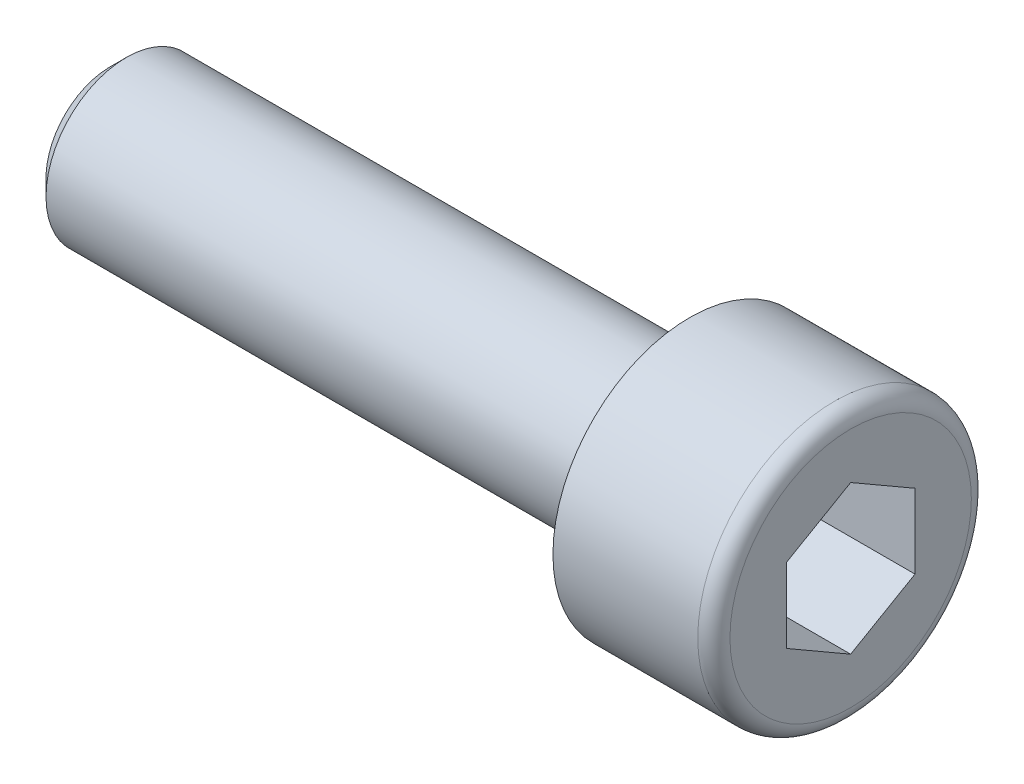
ISO-10303-21;
HEADER;
FILE_DESCRIPTION(('STEP AP214'),'2;1');
FILE_NAME('part.step','',(''),(''),'','','');
FILE_SCHEMA(('AUTOMOTIVE_DESIGN { 1 0 10303 214 1 1 1 1 }'));
ENDSEC;
DATA;
#1=APPLICATION_CONTEXT('core data for automotive mechanical design processes');
#2=APPLICATION_PROTOCOL_DEFINITION('international standard','automotive_design',2000,#1);
#3=PRODUCT_CONTEXT('',#1,'mechanical');
#4=PRODUCT('Part','Part','',(#3));
#5=PRODUCT_RELATED_PRODUCT_CATEGORY('part','',(#4));
#6=PRODUCT_DEFINITION_FORMATION('','',#4);
#7=PRODUCT_DEFINITION_CONTEXT('part definition',#1,'design');
#8=PRODUCT_DEFINITION('design','',#6,#7);
#9=PRODUCT_DEFINITION_SHAPE('','',#8);
#10=(LENGTH_UNIT() NAMED_UNIT(*) SI_UNIT(.MILLI.,.METRE.));
#11=(NAMED_UNIT(*) PLANE_ANGLE_UNIT() SI_UNIT($,.RADIAN.));
#12=(NAMED_UNIT(*) SI_UNIT($,.STERADIAN.) SOLID_ANGLE_UNIT());
#13=UNCERTAINTY_MEASURE_WITH_UNIT(LENGTH_MEASURE(1.E-05),#10,'distance_accuracy_value','');
#14=(GEOMETRIC_REPRESENTATION_CONTEXT(3) GLOBAL_UNCERTAINTY_ASSIGNED_CONTEXT((#13)) GLOBAL_UNIT_ASSIGNED_CONTEXT((#10,
#11,#12)) REPRESENTATION_CONTEXT('',''));
#15=CARTESIAN_POINT('',(0.,0.,0.));
#16=DIRECTION('',(0.,0.,1.));
#17=DIRECTION('',(1.,0.,0.));
#18=AXIS2_PLACEMENT_3D('',#15,#16,#17);
#19=CARTESIAN_POINT('',(5.,4.25,0.));
#20=DIRECTION('',(-1.,0.,0.));
#21=DIRECTION('',(0.,0.,1.));
#22=AXIS2_PLACEMENT_3D('',#19,#20,#21);
#23=PLANE('',#22);
#24=CARTESIAN_POINT('',(5.,0.,0.));
#25=DIRECTION('',(-1.,0.,0.));
#26=DIRECTION('',(0.,0.,1.));
#27=AXIS2_PLACEMENT_3D('',#24,#25,#26);
#28=CIRCLE('',#27,3.75);
#29=CARTESIAN_POINT('',(5.,0.,3.75));
#30=VERTEX_POINT('',#29);
#31=EDGE_CURVE('E465',#30,#30,#28,.F.);
#32=ORIENTED_EDGE('',*,*,#31,.T.);
#33=EDGE_LOOP('',(#32));
#34=FACE_BOUND('',#33,.T.);
#35=DIRECTION('',(0.,0.500000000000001,-0.866025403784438));
#36=VECTOR('',#35,1.);
#37=CARTESIAN_POINT('',(5.,-1.15470053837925,-2.));
#38=LINE('',#37,#36);
#39=CARTESIAN_POINT('',(5.,-2.3094010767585,0.));
#40=VERTEX_POINT('',#39);
#41=CARTESIAN_POINT('',(5.,-1.15470053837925,-2.));
#42=VERTEX_POINT('',#41);
#43=EDGE_CURVE('E418',#40,#42,#38,.T.);
#44=ORIENTED_EDGE('',*,*,#43,.F.);
#45=DIRECTION('',(0.,-0.5,-0.866025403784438));
#46=VECTOR('',#45,1.);
#47=CARTESIAN_POINT('',(5.,-1.15470053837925,2.));
#48=LINE('',#47,#46);
#49=CARTESIAN_POINT('',(5.,-1.15470053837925,2.));
#50=VERTEX_POINT('',#49);
#51=EDGE_CURVE('E364',#50,#40,#48,.T.);
#52=ORIENTED_EDGE('',*,*,#51,.F.);
#53=DIRECTION('',(0.,-1.,0.));
#54=VECTOR('',#53,1.);
#55=CARTESIAN_POINT('',(5.,1.15470053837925,2.));
#56=LINE('',#55,#54);
#57=CARTESIAN_POINT('',(5.,1.15470053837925,2.));
#58=VERTEX_POINT('',#57);
#59=EDGE_CURVE('E432',#58,#50,#56,.T.);
#60=ORIENTED_EDGE('',*,*,#59,.F.);
#61=DIRECTION('',(0.,-0.500000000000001,0.866025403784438));
#62=VECTOR('',#61,1.);
#63=CARTESIAN_POINT('',(5.,1.15470053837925,2.));
#64=LINE('',#63,#62);
#65=CARTESIAN_POINT('',(5.,2.3094010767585,0.));
#66=VERTEX_POINT('',#65);
#67=EDGE_CURVE('E426',#66,#58,#64,.T.);
#68=ORIENTED_EDGE('',*,*,#67,.F.);
#69=DIRECTION('',(0.,0.500000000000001,0.866025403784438));
#70=VECTOR('',#69,1.);
#71=CARTESIAN_POINT('',(5.,1.15470053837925,-2.));
#72=LINE('',#71,#70);
#73=CARTESIAN_POINT('',(5.,1.15470053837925,-2.));
#74=VERTEX_POINT('',#73);
#75=EDGE_CURVE('E424',#74,#66,#72,.T.);
#76=ORIENTED_EDGE('',*,*,#75,.F.);
#77=DIRECTION('',(0.,1.,0.));
#78=VECTOR('',#77,1.);
#79=CARTESIAN_POINT('',(5.,1.15470053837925,-2.));
#80=LINE('',#79,#78);
#81=EDGE_CURVE('E407',#42,#74,#80,.T.);
#82=ORIENTED_EDGE('',*,*,#81,.F.);
#83=EDGE_LOOP('',(#44,#52,#60,#68,#76,#82));
#84=FACE_BOUND('',#83,.T.);
#85=ADVANCED_FACE('F350',(#34,#84),#23,.F.);
#86=CARTESIAN_POINT('',(-120.,0.,0.));
#87=DIRECTION('',(-1.,0.,0.));
#88=DIRECTION('',(0.,0.,1.));
#89=AXIS2_PLACEMENT_3D('',#86,#87,#88);
#90=CYLINDRICAL_SURFACE('',#89,4.25);
#91=CARTESIAN_POINT('',(4.5,0.,0.));
#92=DIRECTION('',(-1.,0.,0.));
#93=DIRECTION('',(0.,0.,1.));
#94=AXIS2_PLACEMENT_3D('',#91,#92,#93);
#95=CIRCLE('',#94,4.25);
#96=CARTESIAN_POINT('',(4.5,0.,4.25));
#97=VERTEX_POINT('',#96);
#98=EDGE_CURVE('E462',#97,#97,#95,.T.);
#99=ORIENTED_EDGE('',*,*,#98,.T.);
#100=EDGE_LOOP('',(#99));
#101=FACE_BOUND('',#100,.T.);
#102=CARTESIAN_POINT('',(0.,0.,0.));
#103=DIRECTION('',(-1.,0.,0.));
#104=DIRECTION('',(0.,0.,1.));
#105=AXIS2_PLACEMENT_3D('',#102,#103,#104);
#106=CIRCLE('',#105,4.25);
#107=CARTESIAN_POINT('',(0.,0.,4.25));
#108=VERTEX_POINT('',#107);
#109=EDGE_CURVE('E459',#108,#108,#106,.T.);
#110=ORIENTED_EDGE('',*,*,#109,.F.);
#111=EDGE_LOOP('',(#110));
#112=FACE_BOUND('',#111,.T.);
#113=ADVANCED_FACE('F485',(#101,#112),#90,.T.);
#114=CARTESIAN_POINT('',(0.,2.5,0.));
#115=DIRECTION('',(1.,0.,0.));
#116=DIRECTION('',(0.,0.,-1.));
#117=AXIS2_PLACEMENT_3D('',#114,#115,#116);
#118=PLANE('',#117);
#119=CARTESIAN_POINT('',(0.,0.,0.));
#120=DIRECTION('',(-1.,0.,0.));
#121=DIRECTION('',(0.,0.,1.));
#122=AXIS2_PLACEMENT_3D('',#119,#120,#121);
#123=CIRCLE('',#122,2.5);
#124=CARTESIAN_POINT('',(0.,0.,2.5));
#125=VERTEX_POINT('',#124);
#126=EDGE_CURVE('E450',#125,#125,#123,.T.);
#127=ORIENTED_EDGE('',*,*,#126,.F.);
#128=EDGE_LOOP('',(#127));
#129=FACE_BOUND('',#128,.T.);
#130=ORIENTED_EDGE('',*,*,#109,.T.);
#131=EDGE_LOOP('',(#130));
#132=FACE_BOUND('',#131,.T.);
#133=ADVANCED_FACE('F490',(#129,#132),#118,.F.);
#134=CARTESIAN_POINT('',(-120.,0.,0.));
#135=DIRECTION('',(-1.,0.,0.));
#136=DIRECTION('',(0.,0.,1.));
#137=AXIS2_PLACEMENT_3D('',#134,#135,#136);
#138=CYLINDRICAL_SURFACE('',#137,2.5);
#139=CARTESIAN_POINT('',(-17.5,0.,0.));
#140=DIRECTION('',(1.,0.,0.));
#141=DIRECTION('',(0.,0.,-1.));
#142=AXIS2_PLACEMENT_3D('',#139,#140,#141);
#143=CIRCLE('',#142,2.5);
#144=CARTESIAN_POINT('',(-17.5,0.,-2.5));
#145=VERTEX_POINT('',#144);
#146=EDGE_CURVE('E11',#145,#145,#143,.T.);
#147=ORIENTED_EDGE('',*,*,#146,.T.);
#148=EDGE_LOOP('',(#147));
#149=FACE_BOUND('',#148,.T.);
#150=ORIENTED_EDGE('',*,*,#126,.T.);
#151=EDGE_LOOP('',(#150));
#152=FACE_BOUND('',#151,.T.);
#153=ADVANCED_FACE('F499',(#149,#152),#138,.T.);
#154=CARTESIAN_POINT('',(-18.,0.,0.));
#155=DIRECTION('',(1.,0.,0.));
#156=DIRECTION('',(0.,0.,-1.));
#157=AXIS2_PLACEMENT_3D('',#154,#155,#156);
#158=PLANE('',#157);
#159=CARTESIAN_POINT('',(-18.,0.,0.));
#160=DIRECTION('',(1.,0.,0.));
#161=DIRECTION('',(0.,0.,-1.));
#162=AXIS2_PLACEMENT_3D('',#159,#160,#161);
#163=CIRCLE('',#162,1.99999999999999);
#164=CARTESIAN_POINT('',(-18.,0.,-1.99999999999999));
#165=VERTEX_POINT('',#164);
#166=EDGE_CURVE('E357',#165,#165,#163,.F.);
#167=ORIENTED_EDGE('',*,*,#166,.T.);
#168=EDGE_LOOP('',(#167));
#169=FACE_BOUND('',#168,.T.);
#170=ADVANCED_FACE('F470',(#169),#158,.F.);
#171=CARTESIAN_POINT('',(0.999999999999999,-1.15470053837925,2.));
#172=DIRECTION('',(0.,-0.866025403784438,0.5));
#173=DIRECTION('',(0.,-0.5,-0.866025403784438));
#174=AXIS2_PLACEMENT_3D('',#171,#172,#173);
#175=PLANE('',#174);
#176=ORIENTED_EDGE('',*,*,#51,.T.);
#177=DIRECTION('',(1.,0.,0.));
#178=VECTOR('',#177,1.);
#179=CARTESIAN_POINT('',(0.999999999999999,-2.3094010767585,0.));
#180=LINE('',#179,#178);
#181=CARTESIAN_POINT('',(0.999999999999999,-2.3094010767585,0.));
#182=VERTEX_POINT('',#181);
#183=EDGE_CURVE('E415',#182,#40,#180,.T.);
#184=ORIENTED_EDGE('',*,*,#183,.F.);
#185=DIRECTION('',(0.,-0.5,-0.866025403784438));
#186=VECTOR('',#185,1.);
#187=CARTESIAN_POINT('',(0.999999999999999,-1.15470053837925,2.));
#188=LINE('',#187,#186);
#189=CARTESIAN_POINT('',(0.999999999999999,-1.15470053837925,2.));
#190=VERTEX_POINT('',#189);
#191=EDGE_CURVE('E434',#190,#182,#188,.T.);
#192=ORIENTED_EDGE('',*,*,#191,.F.);
#193=DIRECTION('',(1.,0.,0.));
#194=VECTOR('',#193,1.);
#195=CARTESIAN_POINT('',(0.999999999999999,-1.15470053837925,2.));
#196=LINE('',#195,#194);
#197=EDGE_CURVE('E371',#190,#50,#196,.T.);
#198=ORIENTED_EDGE('',*,*,#197,.T.);
#199=EDGE_LOOP('',(#176,#184,#192,#198));
#200=FACE_BOUND('',#199,.T.);
#201=ADVANCED_FACE('F511',(#200),#175,.F.);
#202=CARTESIAN_POINT('',(0.999999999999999,1.15470053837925,2.));
#203=DIRECTION('',(0.,0.,1.));
#204=DIRECTION('',(0.,-1.,0.));
#205=AXIS2_PLACEMENT_3D('',#202,#203,#204);
#206=PLANE('',#205);
#207=ORIENTED_EDGE('',*,*,#59,.T.);
#208=ORIENTED_EDGE('',*,*,#197,.F.);
#209=DIRECTION('',(0.,-1.,0.));
#210=VECTOR('',#209,1.);
#211=CARTESIAN_POINT('',(0.999999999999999,1.15470053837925,2.));
#212=LINE('',#211,#210);
#213=CARTESIAN_POINT('',(0.999999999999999,1.15470053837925,2.));
#214=VERTEX_POINT('',#213);
#215=EDGE_CURVE('E446',#214,#190,#212,.T.);
#216=ORIENTED_EDGE('',*,*,#215,.F.);
#217=DIRECTION('',(1.,0.,0.));
#218=VECTOR('',#217,1.);
#219=CARTESIAN_POINT('',(0.999999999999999,1.15470053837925,2.));
#220=LINE('',#219,#218);
#221=EDGE_CURVE('E451',#214,#58,#220,.T.);
#222=ORIENTED_EDGE('',*,*,#221,.T.);
#223=EDGE_LOOP('',(#207,#208,#216,#222));
#224=FACE_BOUND('',#223,.T.);
#225=ADVANCED_FACE('F514',(#224),#206,.F.);
#226=CARTESIAN_POINT('',(0.999999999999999,1.15470053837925,2.));
#227=DIRECTION('',(0.,0.866025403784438,0.500000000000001));
#228=DIRECTION('',(0.,-0.500000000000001,0.866025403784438));
#229=AXIS2_PLACEMENT_3D('',#226,#227,#228);
#230=PLANE('',#229);
#231=ORIENTED_EDGE('',*,*,#67,.T.);
#232=ORIENTED_EDGE('',*,*,#221,.F.);
#233=DIRECTION('',(0.,-0.500000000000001,0.866025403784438));
#234=VECTOR('',#233,1.);
#235=CARTESIAN_POINT('',(0.999999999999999,1.15470053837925,2.));
#236=LINE('',#235,#234);
#237=CARTESIAN_POINT('',(0.999999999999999,2.3094010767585,0.));
#238=VERTEX_POINT('',#237);
#239=EDGE_CURVE('E443',#238,#214,#236,.T.);
#240=ORIENTED_EDGE('',*,*,#239,.F.);
#241=DIRECTION('',(1.,0.,0.));
#242=VECTOR('',#241,1.);
#243=CARTESIAN_POINT('',(0.999999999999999,2.3094010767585,0.));
#244=LINE('',#243,#242);
#245=EDGE_CURVE('E453',#238,#66,#244,.T.);
#246=ORIENTED_EDGE('',*,*,#245,.T.);
#247=EDGE_LOOP('',(#231,#232,#240,#246));
#248=FACE_BOUND('',#247,.T.);
#249=ADVANCED_FACE('F522',(#248),#230,.F.);
#250=CARTESIAN_POINT('',(0.999999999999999,1.15470053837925,-2.));
#251=DIRECTION('',(0.,0.866025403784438,-0.500000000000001));
#252=DIRECTION('',(0.,0.500000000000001,0.866025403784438));
#253=AXIS2_PLACEMENT_3D('',#250,#251,#252);
#254=PLANE('',#253);
#255=ORIENTED_EDGE('',*,*,#75,.T.);
#256=ORIENTED_EDGE('',*,*,#245,.F.);
#257=DIRECTION('',(0.,0.500000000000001,0.866025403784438));
#258=VECTOR('',#257,1.);
#259=CARTESIAN_POINT('',(0.999999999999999,1.15470053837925,-2.));
#260=LINE('',#259,#258);
#261=CARTESIAN_POINT('',(0.999999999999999,1.15470053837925,-2.));
#262=VERTEX_POINT('',#261);
#263=EDGE_CURVE('E440',#262,#238,#260,.T.);
#264=ORIENTED_EDGE('',*,*,#263,.F.);
#265=DIRECTION('',(1.,0.,0.));
#266=VECTOR('',#265,1.);
#267=CARTESIAN_POINT('',(0.999999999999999,1.15470053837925,-2.));
#268=LINE('',#267,#266);
#269=EDGE_CURVE('E414',#262,#74,#268,.T.);
#270=ORIENTED_EDGE('',*,*,#269,.T.);
#271=EDGE_LOOP('',(#255,#256,#264,#270));
#272=FACE_BOUND('',#271,.T.);
#273=ADVANCED_FACE('F519',(#272),#254,.F.);
#274=CARTESIAN_POINT('',(0.999999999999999,1.15470053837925,-2.));
#275=DIRECTION('',(0.,0.,-1.));
#276=DIRECTION('',(0.,1.,0.));
#277=AXIS2_PLACEMENT_3D('',#274,#275,#276);
#278=PLANE('',#277);
#279=ORIENTED_EDGE('',*,*,#81,.T.);
#280=ORIENTED_EDGE('',*,*,#269,.F.);
#281=DIRECTION('',(0.,1.,0.));
#282=VECTOR('',#281,1.);
#283=CARTESIAN_POINT('',(0.999999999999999,1.15470053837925,-2.));
#284=LINE('',#283,#282);
#285=CARTESIAN_POINT('',(0.999999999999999,-1.15470053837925,-2.));
#286=VERTEX_POINT('',#285);
#287=EDGE_CURVE('E410',#286,#262,#284,.T.);
#288=ORIENTED_EDGE('',*,*,#287,.F.);
#289=DIRECTION('',(1.,0.,0.));
#290=VECTOR('',#289,1.);
#291=CARTESIAN_POINT('',(0.999999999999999,-1.15470053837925,-2.));
#292=LINE('',#291,#290);
#293=EDGE_CURVE('E403',#286,#42,#292,.T.);
#294=ORIENTED_EDGE('',*,*,#293,.T.);
#295=EDGE_LOOP('',(#279,#280,#288,#294));
#296=FACE_BOUND('',#295,.T.);
#297=ADVANCED_FACE('F405',(#296),#278,.F.);
#298=CARTESIAN_POINT('',(0.999999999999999,-1.15470053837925,-2.));
#299=DIRECTION('',(0.,-0.866025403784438,-0.500000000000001));
#300=DIRECTION('',(0.,0.500000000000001,-0.866025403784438));
#301=AXIS2_PLACEMENT_3D('',#298,#299,#300);
#302=PLANE('',#301);
#303=ORIENTED_EDGE('',*,*,#43,.T.);
#304=ORIENTED_EDGE('',*,*,#293,.F.);
#305=DIRECTION('',(0.,0.500000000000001,-0.866025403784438));
#306=VECTOR('',#305,1.);
#307=CARTESIAN_POINT('',(0.999999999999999,-1.15470053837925,-2.));
#308=LINE('',#307,#306);
#309=EDGE_CURVE('E437',#182,#286,#308,.T.);
#310=ORIENTED_EDGE('',*,*,#309,.F.);
#311=ORIENTED_EDGE('',*,*,#183,.T.);
#312=EDGE_LOOP('',(#303,#304,#310,#311));
#313=FACE_BOUND('',#312,.T.);
#314=ADVANCED_FACE('F419',(#313),#302,.F.);
#315=CARTESIAN_POINT('',(0.999999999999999,0.,3.99999999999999));
#316=DIRECTION('',(1.,0.,0.));
#317=DIRECTION('',(0.,0.,-1.));
#318=AXIS2_PLACEMENT_3D('',#315,#316,#317);
#319=PLANE('',#318);
#320=ORIENTED_EDGE('',*,*,#191,.T.);
#321=ORIENTED_EDGE('',*,*,#309,.T.);
#322=ORIENTED_EDGE('',*,*,#287,.T.);
#323=ORIENTED_EDGE('',*,*,#263,.T.);
#324=ORIENTED_EDGE('',*,*,#239,.T.);
#325=ORIENTED_EDGE('',*,*,#215,.T.);
#326=EDGE_LOOP('',(#320,#321,#322,#323,#324,#325));
#327=FACE_BOUND('',#326,.T.);
#328=ADVANCED_FACE('F480',(#327),#319,.T.);
#329=CARTESIAN_POINT('',(4.5,0.,0.));
#330=DIRECTION('',(-1.,0.,0.));
#331=DIRECTION('',(0.,0.,1.));
#332=AXIS2_PLACEMENT_3D('',#329,#330,#331);
#333=TOROIDAL_SURFACE('',#332,3.75,0.5);
#334=ORIENTED_EDGE('',*,*,#31,.F.);
#335=EDGE_LOOP('',(#334));
#336=FACE_BOUND('',#335,.T.);
#337=ORIENTED_EDGE('',*,*,#98,.F.);
#338=EDGE_LOOP('',(#337));
#339=FACE_BOUND('',#338,.T.);
#340=ADVANCED_FACE('F474',(#336,#339),#333,.T.);
#341=CARTESIAN_POINT('',(-18.,0.,0.));
#342=DIRECTION('',(1.,0.,0.));
#343=DIRECTION('',(0.,0.,-1.));
#344=AXIS2_PLACEMENT_3D('',#341,#342,#343);
#345=CONICAL_SURFACE('',#344,1.99999999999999,0.785398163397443);
#346=ORIENTED_EDGE('',*,*,#146,.F.);
#347=EDGE_LOOP('',(#346));
#348=FACE_BOUND('',#347,.T.);
#349=ORIENTED_EDGE('',*,*,#166,.F.);
#350=EDGE_LOOP('',(#349));
#351=FACE_BOUND('',#350,.T.);
#352=ADVANCED_FACE('F472',(#348,#351),#345,.T.);
#353=CLOSED_SHELL('',(#85,#113,#133,#153,#170,#201,#225,#249,#273,#297,#314,#328,#340,#352));
#354=MANIFOLD_SOLID_BREP('B2',#353);
#355=ADVANCED_BREP_SHAPE_REPRESENTATION('',(#18,#354),#14);
#356=SHAPE_DEFINITION_REPRESENTATION(#9,#355);
ENDSEC;
END-ISO-10303-21;
